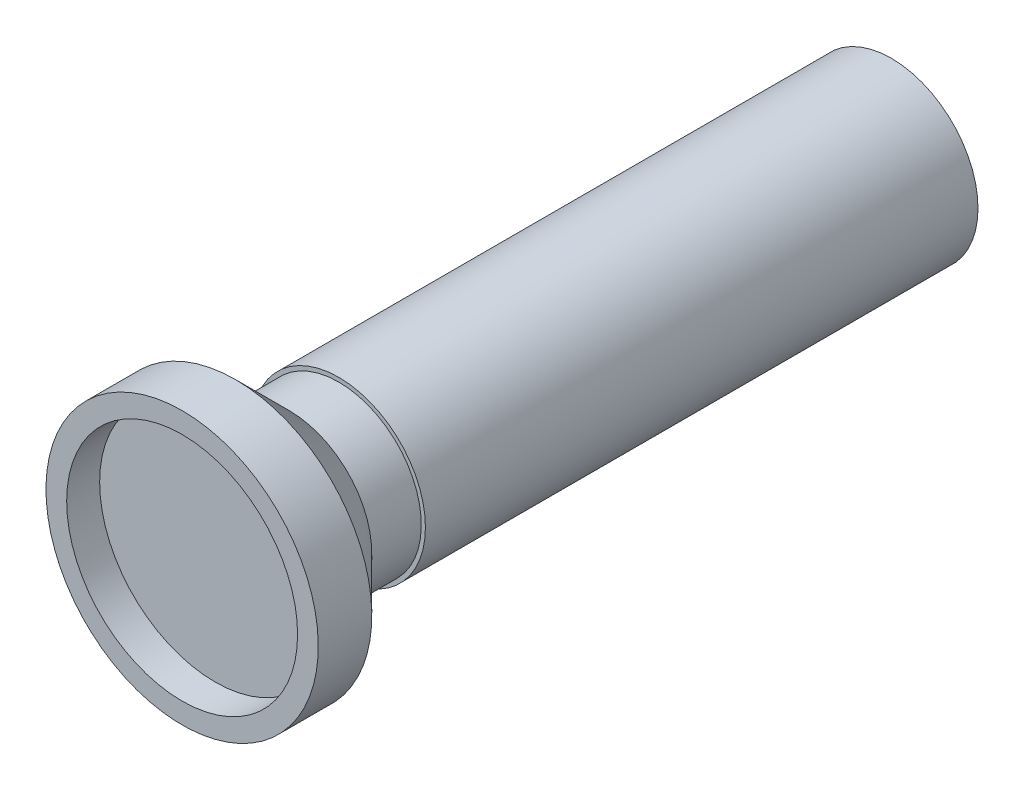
ISO-10303-21;
HEADER;
FILE_DESCRIPTION(('STEP AP214'),'2;1');
FILE_NAME('part.step','',(''),(''),'','','');
FILE_SCHEMA(('AUTOMOTIVE_DESIGN { 1 0 10303 214 1 1 1 1 }'));
ENDSEC;
DATA;
#1=APPLICATION_CONTEXT('core data for automotive mechanical design processes');
#2=APPLICATION_PROTOCOL_DEFINITION('international standard','automotive_design',2000,#1);
#3=PRODUCT_CONTEXT('',#1,'mechanical');
#4=PRODUCT('Part','Part','',(#3));
#5=PRODUCT_RELATED_PRODUCT_CATEGORY('part','',(#4));
#6=PRODUCT_DEFINITION_FORMATION('','',#4);
#7=PRODUCT_DEFINITION_CONTEXT('part definition',#1,'design');
#8=PRODUCT_DEFINITION('design','',#6,#7);
#9=PRODUCT_DEFINITION_SHAPE('','',#8);
#10=(LENGTH_UNIT() NAMED_UNIT(*) SI_UNIT(.MILLI.,.METRE.));
#11=(NAMED_UNIT(*) PLANE_ANGLE_UNIT() SI_UNIT($,.RADIAN.));
#12=(NAMED_UNIT(*) SI_UNIT($,.STERADIAN.) SOLID_ANGLE_UNIT());
#13=UNCERTAINTY_MEASURE_WITH_UNIT(LENGTH_MEASURE(1.E-05),#10,'distance_accuracy_value','');
#14=(GEOMETRIC_REPRESENTATION_CONTEXT(3) GLOBAL_UNCERTAINTY_ASSIGNED_CONTEXT((#13)) GLOBAL_UNIT_ASSIGNED_CONTEXT((#10,
#11,#12)) REPRESENTATION_CONTEXT('',''));
#15=CARTESIAN_POINT('',(0.,0.,0.));
#16=DIRECTION('',(0.,0.,1.));
#17=DIRECTION('',(1.,0.,0.));
#18=AXIS2_PLACEMENT_3D('',#15,#16,#17);
#19=CARTESIAN_POINT('',(-86.6774916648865,-86.6774916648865,430.));
#20=DIRECTION('',(0.,0.,1.));
#21=DIRECTION('',(1.,0.,0.));
#22=AXIS2_PLACEMENT_3D('',#19,#20,#21);
#23=PLANE('',#22);
#24=CARTESIAN_POINT('',(-1.42247325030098E-13,0.,430.));
#25=DIRECTION('',(0.,0.,-1.));
#26=DIRECTION('',(0.,1.,0.));
#27=AXIS2_PLACEMENT_3D('',#24,#25,#26);
#28=CIRCLE('',#27,70.);
#29=CARTESIAN_POINT('',(69.9999999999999,0.,430.));
#30=VERTEX_POINT('',#29);
#31=EDGE_CURVE('E9',#30,#30,#28,.T.);
#32=ORIENTED_EDGE('',*,*,#31,.T.);
#33=EDGE_LOOP('',(#32));
#34=FACE_BOUND('',#33,.T.);
#35=CARTESIAN_POINT('',(-1.68623856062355E-13,0.,430.));
#36=DIRECTION('',(0.,0.,-1.));
#37=DIRECTION('',(-1.,0.,0.));
#38=AXIS2_PLACEMENT_3D('',#35,#36,#37);
#39=CIRCLE('',#38,82.5499999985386);
#40=CARTESIAN_POINT('',(1.097178E-13,82.5499999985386,430.));
#41=VERTEX_POINT('',#40);
#42=EDGE_CURVE('E24',#41,#41,#39,.T.);
#43=ORIENTED_EDGE('',*,*,#42,.F.);
#44=EDGE_LOOP('',(#43));
#45=FACE_BOUND('',#44,.T.);
#46=ADVANCED_FACE('F14',(#34,#45),#23,.T.);
#47=CARTESIAN_POINT('',(-1.08818902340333E-13,0.,397.55));
#48=DIRECTION('',(0.,0.,1.));
#49=DIRECTION('',(1.,0.,0.));
#50=AXIS2_PLACEMENT_3D('',#47,#48,#49);
#51=CYLINDRICAL_SURFACE('',#50,82.5499999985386);
#52=CARTESIAN_POINT('',(-1.68623856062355E-13,0.,397.55));
#53=DIRECTION('',(0.,0.,-1.));
#54=DIRECTION('',(-1.,0.,0.));
#55=AXIS2_PLACEMENT_3D('',#52,#53,#54);
#56=CIRCLE('',#55,82.5499999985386);
#57=CARTESIAN_POINT('',(1.034786E-13,82.5499999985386,397.55));
#58=VERTEX_POINT('',#57);
#59=EDGE_CURVE('E169',#58,#58,#56,.T.);
#60=ORIENTED_EDGE('',*,*,#59,.F.);
#61=DIRECTION('',(0.,0.,-1.));
#62=VECTOR('',#61,1.);
#63=CARTESIAN_POINT('',(1.097178E-13,82.5499999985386,413.775));
#64=LINE('',#63,#62);
#65=EDGE_CURVE('E173',#41,#58,#64,.T.);
#66=ORIENTED_EDGE('',*,*,#65,.F.);
#67=ORIENTED_EDGE('',*,*,#42,.T.);
#68=ORIENTED_EDGE('',*,*,#65,.T.);
#69=EDGE_LOOP('',(#60,#66,#67,#68));
#70=FACE_BOUND('',#69,.T.);
#71=ADVANCED_FACE('F84',(#70),#51,.T.);
#72=CARTESIAN_POINT('',(0.,0.,365.));
#73=DIRECTION('',(0.,0.,1.));
#74=DIRECTION('',(1.,0.,0.));
#75=AXIS2_PLACEMENT_3D('',#72,#73,#74);
#76=CONICAL_SURFACE('',#75,50.,0.785398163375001);
#77=CARTESIAN_POINT('',(0.,0.,365.));
#78=DIRECTION('',(0.,0.,-1.));
#79=DIRECTION('',(-1.,0.,0.));
#80=AXIS2_PLACEMENT_3D('',#77,#78,#79);
#81=CIRCLE('',#80,50.);
#82=CARTESIAN_POINT('',(0.,50.0000000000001,365.));
#83=VERTEX_POINT('',#82);
#84=EDGE_CURVE('E60',#83,#83,#81,.T.);
#85=ORIENTED_EDGE('',*,*,#84,.F.);
#86=DIRECTION('',(0.,-0.707106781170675,-0.70710678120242));
#87=VECTOR('',#86,1.);
#88=CARTESIAN_POINT('',(0.,66.2749999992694,381.275));
#89=LINE('',#88,#87);
#90=EDGE_CURVE('E168',#58,#83,#89,.T.);
#91=ORIENTED_EDGE('',*,*,#90,.F.);
#92=ORIENTED_EDGE('',*,*,#59,.T.);
#93=ORIENTED_EDGE('',*,*,#90,.T.);
#94=EDGE_LOOP('',(#85,#91,#92,#93));
#95=FACE_BOUND('',#94,.T.);
#96=ADVANCED_FACE('F90',(#95),#76,.T.);
#97=CARTESIAN_POINT('',(0.,0.,335.));
#98=DIRECTION('',(0.,0.,1.));
#99=DIRECTION('',(1.,0.,0.));
#100=AXIS2_PLACEMENT_3D('',#97,#98,#99);
#101=CYLINDRICAL_SURFACE('',#100,50.);
#102=CARTESIAN_POINT('',(0.,1.00613961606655E-13,335.));
#103=DIRECTION('',(0.,0.,-1.));
#104=DIRECTION('',(-1.,0.,0.));
#105=AXIS2_PLACEMENT_3D('',#102,#103,#104);
#106=CIRCLE('',#105,50.);
#107=CARTESIAN_POINT('',(0.,50.0000000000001,335.));
#108=VERTEX_POINT('',#107);
#109=EDGE_CURVE('E52',#108,#108,#106,.T.);
#110=ORIENTED_EDGE('',*,*,#109,.F.);
#111=DIRECTION('',(0.,0.,-1.));
#112=VECTOR('',#111,1.);
#113=CARTESIAN_POINT('',(0.,50.0000000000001,350.));
#114=LINE('',#113,#112);
#115=EDGE_CURVE('E55',#83,#108,#114,.T.);
#116=ORIENTED_EDGE('',*,*,#115,.F.);
#117=ORIENTED_EDGE('',*,*,#84,.T.);
#118=ORIENTED_EDGE('',*,*,#115,.T.);
#119=EDGE_LOOP('',(#110,#116,#117,#118));
#120=FACE_BOUND('',#119,.T.);
#121=ADVANCED_FACE('F53',(#120),#101,.T.);
#122=CARTESIAN_POINT('',(55.1249943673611,-55.1249943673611,335.));
#123=DIRECTION('',(0.,0.,1.));
#124=DIRECTION('',(0.,1.,0.));
#125=AXIS2_PLACEMENT_3D('',#122,#123,#124);
#126=PLANE('',#125);
#127=ORIENTED_EDGE('',*,*,#109,.T.);
#128=EDGE_LOOP('',(#127));
#129=FACE_BOUND('',#128,.T.);
#130=CARTESIAN_POINT('',(0.,0.,335.));
#131=DIRECTION('',(0.,0.,-1.));
#132=DIRECTION('',(0.,1.,0.));
#133=AXIS2_PLACEMENT_3D('',#130,#131,#132);
#134=CIRCLE('',#133,52.5);
#135=CARTESIAN_POINT('',(52.5000000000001,0.,335.));
#136=VERTEX_POINT('',#135);
#137=EDGE_CURVE('E63',#136,#136,#134,.T.);
#138=ORIENTED_EDGE('',*,*,#137,.F.);
#139=EDGE_LOOP('',(#138));
#140=FACE_BOUND('',#139,.T.);
#141=ADVANCED_FACE('F100',(#129,#140),#126,.T.);
#142=CARTESIAN_POINT('',(0.,0.,0.));
#143=DIRECTION('',(0.,0.,1.));
#144=DIRECTION('',(1.,0.,0.));
#145=AXIS2_PLACEMENT_3D('',#142,#143,#144);
#146=CYLINDRICAL_SURFACE('',#145,52.5);
#147=CARTESIAN_POINT('',(0.,0.,0.));
#148=DIRECTION('',(0.,0.,1.));
#149=DIRECTION('',(1.,0.,0.));
#150=AXIS2_PLACEMENT_3D('',#147,#148,#149);
#151=CIRCLE('',#150,52.5);
#152=CARTESIAN_POINT('',(52.5000000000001,0.,0.));
#153=VERTEX_POINT('',#152);
#154=EDGE_CURVE('E58',#153,#153,#151,.T.);
#155=ORIENTED_EDGE('',*,*,#154,.T.);
#156=DIRECTION('',(0.,0.,-1.));
#157=VECTOR('',#156,1.);
#158=CARTESIAN_POINT('',(52.5000000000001,0.,167.5));
#159=LINE('',#158,#157);
#160=EDGE_CURVE('E69',#136,#153,#159,.T.);
#161=ORIENTED_EDGE('',*,*,#160,.F.);
#162=ORIENTED_EDGE('',*,*,#137,.T.);
#163=ORIENTED_EDGE('',*,*,#160,.T.);
#164=EDGE_LOOP('',(#155,#161,#162,#163));
#165=FACE_BOUND('',#164,.T.);
#166=ADVANCED_FACE('F80',(#165),#146,.T.);
#167=CARTESIAN_POINT('',(-55.1249943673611,55.1249943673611,0.));
#168=DIRECTION('',(0.,0.,-1.));
#169=DIRECTION('',(1.,0.,0.));
#170=AXIS2_PLACEMENT_3D('',#167,#168,#169);
#171=PLANE('',#170);
#172=ORIENTED_EDGE('',*,*,#154,.F.);
#173=EDGE_LOOP('',(#172));
#174=FACE_BOUND('',#173,.T.);
#175=ADVANCED_FACE('F74',(#174),#171,.T.);
#176=CARTESIAN_POINT('',(-1.42247325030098E-13,0.,430.));
#177=DIRECTION('',(0.,0.,-1.));
#178=DIRECTION('',(0.,1.,0.));
#179=AXIS2_PLACEMENT_3D('',#176,#177,#178);
#180=CYLINDRICAL_SURFACE('',#179,70.);
#181=ORIENTED_EDGE('',*,*,#31,.F.);
#182=DIRECTION('',(0.,0.,-1.));
#183=VECTOR('',#182,1.);
#184=CARTESIAN_POINT('',(69.9999999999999,0.,420.));
#185=LINE('',#184,#183);
#186=CARTESIAN_POINT('',(69.9999999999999,0.,410.));
#187=VERTEX_POINT('',#186);
#188=EDGE_CURVE('E33',#30,#187,#185,.T.);
#189=ORIENTED_EDGE('',*,*,#188,.T.);
#190=CARTESIAN_POINT('',(-1.66533453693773E-13,0.,410.));
#191=DIRECTION('',(0.,0.,1.));
#192=DIRECTION('',(0.,-1.,0.));
#193=AXIS2_PLACEMENT_3D('',#190,#191,#192);
#194=CIRCLE('',#193,70.);
#195=EDGE_CURVE('E18',#187,#187,#194,.T.);
#196=ORIENTED_EDGE('',*,*,#195,.F.);
#197=ORIENTED_EDGE('',*,*,#188,.F.);
#198=EDGE_LOOP('',(#181,#189,#196,#197));
#199=FACE_BOUND('',#198,.T.);
#200=ADVANCED_FACE('F72',(#199),#180,.F.);
#201=CARTESIAN_POINT('',(-73.4999999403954,73.4999999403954,410.));
#202=DIRECTION('',(0.,0.,1.));
#203=DIRECTION('',(0.,-1.,0.));
#204=AXIS2_PLACEMENT_3D('',#201,#202,#203);
#205=PLANE('',#204);
#206=ORIENTED_EDGE('',*,*,#195,.T.);
#207=EDGE_LOOP('',(#206));
#208=FACE_BOUND('',#207,.T.);
#209=ADVANCED_FACE('F16',(#208),#205,.T.);
#210=CLOSED_SHELL('',(#46,#71,#96,#121,#141,#166,#175,#200,#209));
#211=MANIFOLD_SOLID_BREP('B1',#210);
#212=ADVANCED_BREP_SHAPE_REPRESENTATION('',(#18,#211),#14);
#213=SHAPE_DEFINITION_REPRESENTATION(#9,#212);
ENDSEC;
END-ISO-10303-21;
